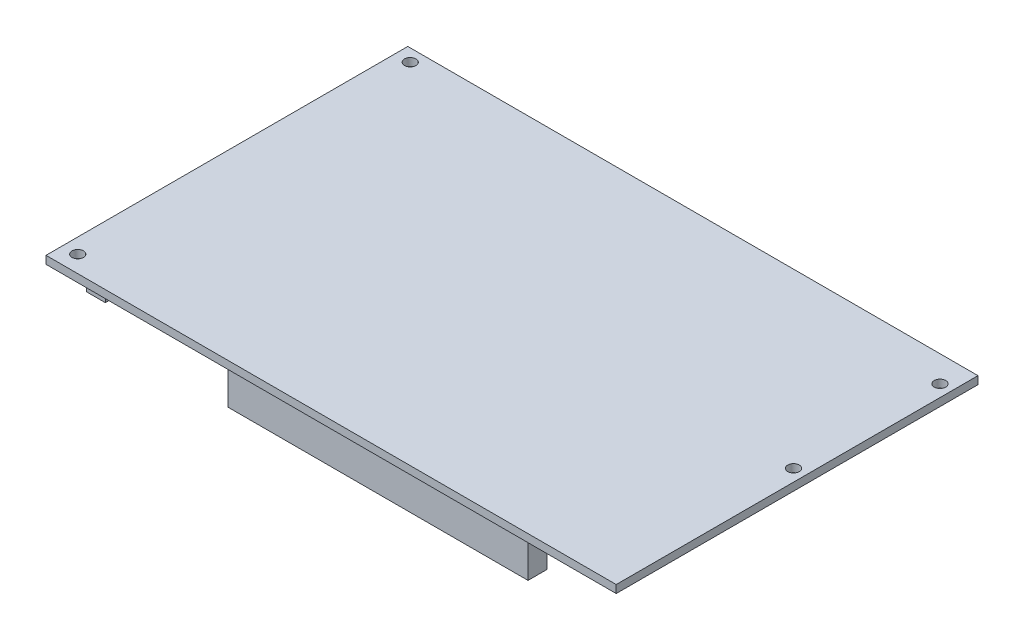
ISO-10303-21;
HEADER;
FILE_DESCRIPTION(('STEP AP214'),'2;1');
FILE_NAME('part.step','',(''),(''),'','','');
FILE_SCHEMA(('AUTOMOTIVE_DESIGN { 1 0 10303 214 1 1 1 1 }'));
ENDSEC;
DATA;
#1=APPLICATION_CONTEXT('core data for automotive mechanical design processes');
#2=APPLICATION_PROTOCOL_DEFINITION('international standard','automotive_design',2000,#1);
#3=PRODUCT_CONTEXT('',#1,'mechanical');
#4=PRODUCT('Part','Part','',(#3));
#5=PRODUCT_RELATED_PRODUCT_CATEGORY('part','',(#4));
#6=PRODUCT_DEFINITION_FORMATION('','',#4);
#7=PRODUCT_DEFINITION_CONTEXT('part definition',#1,'design');
#8=PRODUCT_DEFINITION('design','',#6,#7);
#9=PRODUCT_DEFINITION_SHAPE('','',#8);
#10=(LENGTH_UNIT() NAMED_UNIT(*) SI_UNIT(.MILLI.,.METRE.));
#11=(NAMED_UNIT(*) PLANE_ANGLE_UNIT() SI_UNIT($,.RADIAN.));
#12=(NAMED_UNIT(*) SI_UNIT($,.STERADIAN.) SOLID_ANGLE_UNIT());
#13=UNCERTAINTY_MEASURE_WITH_UNIT(LENGTH_MEASURE(1.E-05),#10,'distance_accuracy_value','');
#14=(GEOMETRIC_REPRESENTATION_CONTEXT(3) GLOBAL_UNCERTAINTY_ASSIGNED_CONTEXT((#13)) GLOBAL_UNIT_ASSIGNED_CONTEXT((#10,
#11,#12)) REPRESENTATION_CONTEXT('',''));
#15=CARTESIAN_POINT('',(0.,0.,0.));
#16=DIRECTION('',(0.,0.,1.));
#17=DIRECTION('',(1.,0.,0.));
#18=AXIS2_PLACEMENT_3D('',#15,#16,#17);
#19=CARTESIAN_POINT('',(0.,0.,-92.5957));
#20=DIRECTION('',(0.,-1.,0.));
#21=DIRECTION('',(0.,0.,-1.));
#22=AXIS2_PLACEMENT_3D('',#19,#20,#21);
#23=PLANE('',#22);
#24=DIRECTION('',(1.,0.,0.));
#25=VECTOR('',#24,1.);
#26=CARTESIAN_POINT('',(45.212,0.,-6.2357));
#27=LINE('',#26,#25);
#28=CARTESIAN_POINT('',(45.212,0.,-6.2357));
#29=VERTEX_POINT('',#28);
#30=CARTESIAN_POINT('',(121.9708,0.,-6.2357));
#31=VERTEX_POINT('',#30);
#32=EDGE_CURVE('E165',#29,#31,#27,.T.);
#33=ORIENTED_EDGE('',*,*,#32,.F.);
#34=DIRECTION('',(0.,0.,-1.));
#35=VECTOR('',#34,1.);
#36=CARTESIAN_POINT('',(45.212,0.,-1.397));
#37=LINE('',#36,#35);
#38=CARTESIAN_POINT('',(45.212,0.,-1.397));
#39=VERTEX_POINT('',#38);
#40=EDGE_CURVE('E134',#39,#29,#37,.T.);
#41=ORIENTED_EDGE('',*,*,#40,.F.);
#42=DIRECTION('',(-1.,0.,0.));
#43=VECTOR('',#42,1.);
#44=CARTESIAN_POINT('',(45.212,0.,-1.397));
#45=LINE('',#44,#43);
#46=CARTESIAN_POINT('',(121.9708,0.,-1.397));
#47=VERTEX_POINT('',#46);
#48=EDGE_CURVE('E169',#47,#39,#45,.T.);
#49=ORIENTED_EDGE('',*,*,#48,.F.);
#50=DIRECTION('',(0.,0.,1.));
#51=VECTOR('',#50,1.);
#52=CARTESIAN_POINT('',(121.9708,0.,-1.397));
#53=LINE('',#52,#51);
#54=EDGE_CURVE('E167',#31,#47,#53,.T.);
#55=ORIENTED_EDGE('',*,*,#54,.F.);
#56=EDGE_LOOP('',(#33,#41,#49,#55));
#57=FACE_BOUND('',#56,.T.);
#58=CARTESIAN_POINT('',(142.875,0.,-85.9155));
#59=DIRECTION('',(0.,1.,0.));
#60=DIRECTION('',(0.,0.,1.));
#61=AXIS2_PLACEMENT_3D('',#58,#59,#60);
#62=CIRCLE('',#61,1.4732);
#63=CARTESIAN_POINT('',(142.875,0.,-84.4423));
#64=VERTEX_POINT('',#63);
#65=EDGE_CURVE('E195',#64,#64,#62,.T.);
#66=ORIENTED_EDGE('',*,*,#65,.T.);
#67=EDGE_LOOP('',(#66));
#68=FACE_BOUND('',#67,.T.);
#69=CARTESIAN_POINT('',(3.81,0.,-89.408));
#70=DIRECTION('',(0.,1.,0.));
#71=DIRECTION('',(0.,0.,1.));
#72=AXIS2_PLACEMENT_3D('',#69,#70,#71);
#73=CIRCLE('',#72,1.4732);
#74=CARTESIAN_POINT('',(3.81,0.,-87.9348));
#75=VERTEX_POINT('',#74);
#76=EDGE_CURVE('E207',#75,#75,#73,.T.);
#77=ORIENTED_EDGE('',*,*,#76,.T.);
#78=EDGE_LOOP('',(#77));
#79=FACE_BOUND('',#78,.T.);
#80=DIRECTION('',(0.,0.,1.));
#81=VECTOR('',#80,1.);
#82=CARTESIAN_POINT('',(0.,0.,0.));
#83=LINE('',#82,#81);
#84=CARTESIAN_POINT('',(0.,0.,-92.5957));
#85=VERTEX_POINT('',#84);
#86=CARTESIAN_POINT('',(0.,0.,0.));
#87=VERTEX_POINT('',#86);
#88=EDGE_CURVE('E213',#85,#87,#83,.T.);
#89=ORIENTED_EDGE('',*,*,#88,.F.);
#90=DIRECTION('',(-1.,0.,0.));
#91=VECTOR('',#90,1.);
#92=CARTESIAN_POINT('',(0.,0.,-92.5957));
#93=LINE('',#92,#91);
#94=CARTESIAN_POINT('',(145.9357,0.,-92.5957));
#95=VERTEX_POINT('',#94);
#96=EDGE_CURVE('E220',#95,#85,#93,.T.);
#97=ORIENTED_EDGE('',*,*,#96,.F.);
#98=DIRECTION('',(0.,0.,-1.));
#99=VECTOR('',#98,1.);
#100=CARTESIAN_POINT('',(145.9357,0.,0.));
#101=LINE('',#100,#99);
#102=CARTESIAN_POINT('',(145.9357,0.,0.));
#103=VERTEX_POINT('',#102);
#104=EDGE_CURVE('E218',#103,#95,#101,.T.);
#105=ORIENTED_EDGE('',*,*,#104,.F.);
#106=DIRECTION('',(1.,0.,0.));
#107=VECTOR('',#106,1.);
#108=CARTESIAN_POINT('',(0.,0.,0.));
#109=LINE('',#108,#107);
#110=EDGE_CURVE('E216',#87,#103,#109,.T.);
#111=ORIENTED_EDGE('',*,*,#110,.F.);
#112=EDGE_LOOP('',(#89,#97,#105,#111));
#113=FACE_BOUND('',#112,.T.);
#114=CARTESIAN_POINT('',(3.81,0.,-4.318));
#115=DIRECTION('',(0.,1.,0.));
#116=DIRECTION('',(0.,0.,1.));
#117=AXIS2_PLACEMENT_3D('',#114,#115,#116);
#118=CIRCLE('',#117,1.4732);
#119=CARTESIAN_POINT('',(3.81,0.,-2.8448));
#120=VERTEX_POINT('',#119);
#121=EDGE_CURVE('E201',#120,#120,#118,.T.);
#122=ORIENTED_EDGE('',*,*,#121,.T.);
#123=EDGE_LOOP('',(#122));
#124=FACE_BOUND('',#123,.T.);
#125=CARTESIAN_POINT('',(142.875,0.,-48.4505));
#126=DIRECTION('',(0.,1.,0.));
#127=DIRECTION('',(0.,0.,1.));
#128=AXIS2_PLACEMENT_3D('',#125,#126,#127);
#129=CIRCLE('',#128,1.4732);
#130=CARTESIAN_POINT('',(142.875,0.,-46.9773));
#131=VERTEX_POINT('',#130);
#132=EDGE_CURVE('E189',#131,#131,#129,.T.);
#133=ORIENTED_EDGE('',*,*,#132,.T.);
#134=EDGE_LOOP('',(#133));
#135=FACE_BOUND('',#134,.T.);
#136=DIRECTION('',(1.,0.,0.));
#137=VECTOR('',#136,1.);
#138=CARTESIAN_POINT('',(1.47320000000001,0.,-84.836));
#139=LINE('',#138,#137);
#140=CARTESIAN_POINT('',(1.47320000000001,0.,-84.836));
#141=VERTEX_POINT('',#140);
#142=CARTESIAN_POINT('',(6.31190000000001,0.,-84.836));
#143=VERTEX_POINT('',#142);
#144=EDGE_CURVE('E128',#141,#143,#139,.T.);
#145=ORIENTED_EDGE('',*,*,#144,.F.);
#146=DIRECTION('',(0.,0.,-1.));
#147=VECTOR('',#146,1.);
#148=CARTESIAN_POINT('',(1.4732,0.,-8.8646));
#149=LINE('',#148,#147);
#150=CARTESIAN_POINT('',(1.4732,0.,-8.8646));
#151=VERTEX_POINT('',#150);
#152=EDGE_CURVE('E139',#151,#141,#149,.T.);
#153=ORIENTED_EDGE('',*,*,#152,.F.);
#154=DIRECTION('',(-1.,0.,0.));
#155=VECTOR('',#154,1.);
#156=CARTESIAN_POINT('',(1.4732,0.,-8.8646));
#157=LINE('',#156,#155);
#158=CARTESIAN_POINT('',(6.3119,0.,-8.8646));
#159=VERTEX_POINT('',#158);
#160=EDGE_CURVE('E149',#159,#151,#157,.T.);
#161=ORIENTED_EDGE('',*,*,#160,.F.);
#162=DIRECTION('',(0.,0.,1.));
#163=VECTOR('',#162,1.);
#164=CARTESIAN_POINT('',(6.3119,0.,-8.8646));
#165=LINE('',#164,#163);
#166=EDGE_CURVE('E147',#143,#159,#165,.T.);
#167=ORIENTED_EDGE('',*,*,#166,.F.);
#168=EDGE_LOOP('',(#145,#153,#161,#167));
#169=FACE_BOUND('',#168,.T.);
#170=ADVANCED_FACE('F33',(#57,#68,#79,#113,#124,#135,#169),#23,.T.);
#171=CARTESIAN_POINT('',(0.,2.0066,-92.5957));
#172=DIRECTION('',(0.,-1.,0.));
#173=DIRECTION('',(0.,0.,-1.));
#174=AXIS2_PLACEMENT_3D('',#171,#172,#173);
#175=PLANE('',#174);
#176=CARTESIAN_POINT('',(142.875,2.0066,-85.9155));
#177=DIRECTION('',(0.,1.,0.));
#178=DIRECTION('',(0.,0.,1.));
#179=AXIS2_PLACEMENT_3D('',#176,#177,#178);
#180=CIRCLE('',#179,1.4732);
#181=CARTESIAN_POINT('',(142.875,2.0066,-84.4423));
#182=VERTEX_POINT('',#181);
#183=EDGE_CURVE('E198',#182,#182,#180,.T.);
#184=ORIENTED_EDGE('',*,*,#183,.F.);
#185=EDGE_LOOP('',(#184));
#186=FACE_BOUND('',#185,.T.);
#187=CARTESIAN_POINT('',(3.81,2.0066,-89.408));
#188=DIRECTION('',(0.,1.,0.));
#189=DIRECTION('',(0.,0.,1.));
#190=AXIS2_PLACEMENT_3D('',#187,#188,#189);
#191=CIRCLE('',#190,1.4732);
#192=CARTESIAN_POINT('',(3.81,2.0066,-87.9348));
#193=VERTEX_POINT('',#192);
#194=EDGE_CURVE('E210',#193,#193,#191,.T.);
#195=ORIENTED_EDGE('',*,*,#194,.F.);
#196=EDGE_LOOP('',(#195));
#197=FACE_BOUND('',#196,.T.);
#198=DIRECTION('',(0.,0.,1.));
#199=VECTOR('',#198,1.);
#200=CARTESIAN_POINT('',(0.,2.0066,0.));
#201=LINE('',#200,#199);
#202=CARTESIAN_POINT('',(0.,2.0066,-92.5957));
#203=VERTEX_POINT('',#202);
#204=CARTESIAN_POINT('',(0.,2.0066,0.));
#205=VERTEX_POINT('',#204);
#206=EDGE_CURVE('E222',#203,#205,#201,.T.);
#207=ORIENTED_EDGE('',*,*,#206,.T.);
#208=DIRECTION('',(1.,0.,0.));
#209=VECTOR('',#208,1.);
#210=CARTESIAN_POINT('',(0.,2.0066,0.));
#211=LINE('',#210,#209);
#212=CARTESIAN_POINT('',(145.9357,2.0066,0.));
#213=VERTEX_POINT('',#212);
#214=EDGE_CURVE('E225',#205,#213,#211,.T.);
#215=ORIENTED_EDGE('',*,*,#214,.T.);
#216=DIRECTION('',(0.,0.,-1.));
#217=VECTOR('',#216,1.);
#218=CARTESIAN_POINT('',(145.9357,2.0066,0.));
#219=LINE('',#218,#217);
#220=CARTESIAN_POINT('',(145.9357,2.0066,-92.5957));
#221=VERTEX_POINT('',#220);
#222=EDGE_CURVE('E227',#213,#221,#219,.T.);
#223=ORIENTED_EDGE('',*,*,#222,.T.);
#224=DIRECTION('',(-1.,0.,0.));
#225=VECTOR('',#224,1.);
#226=CARTESIAN_POINT('',(0.,2.0066,-92.5957));
#227=LINE('',#226,#225);
#228=EDGE_CURVE('E229',#221,#203,#227,.T.);
#229=ORIENTED_EDGE('',*,*,#228,.T.);
#230=EDGE_LOOP('',(#207,#215,#223,#229));
#231=FACE_BOUND('',#230,.T.);
#232=CARTESIAN_POINT('',(3.81,2.0066,-4.318));
#233=DIRECTION('',(0.,1.,0.));
#234=DIRECTION('',(0.,0.,1.));
#235=AXIS2_PLACEMENT_3D('',#232,#233,#234);
#236=CIRCLE('',#235,1.4732);
#237=CARTESIAN_POINT('',(3.81,2.0066,-2.8448));
#238=VERTEX_POINT('',#237);
#239=EDGE_CURVE('E204',#238,#238,#236,.T.);
#240=ORIENTED_EDGE('',*,*,#239,.F.);
#241=EDGE_LOOP('',(#240));
#242=FACE_BOUND('',#241,.T.);
#243=CARTESIAN_POINT('',(142.875,2.0066,-48.4505));
#244=DIRECTION('',(0.,1.,0.));
#245=DIRECTION('',(0.,0.,1.));
#246=AXIS2_PLACEMENT_3D('',#243,#244,#245);
#247=CIRCLE('',#246,1.4732);
#248=CARTESIAN_POINT('',(142.875,2.0066,-46.9773));
#249=VERTEX_POINT('',#248);
#250=EDGE_CURVE('E192',#249,#249,#247,.T.);
#251=ORIENTED_EDGE('',*,*,#250,.F.);
#252=EDGE_LOOP('',(#251));
#253=FACE_BOUND('',#252,.T.);
#254=ADVANCED_FACE('F256',(#186,#197,#231,#242,#253),#175,.F.);
#255=CARTESIAN_POINT('',(0.,2.0066,0.));
#256=DIRECTION('',(1.,0.,0.));
#257=DIRECTION('',(0.,0.,-1.));
#258=AXIS2_PLACEMENT_3D('',#255,#256,#257);
#259=PLANE('',#258);
#260=ORIENTED_EDGE('',*,*,#88,.T.);
#261=DIRECTION('',(0.,-1.,0.));
#262=VECTOR('',#261,1.);
#263=CARTESIAN_POINT('',(0.,2.0066,0.));
#264=LINE('',#263,#262);
#265=EDGE_CURVE('E11',#205,#87,#264,.T.);
#266=ORIENTED_EDGE('',*,*,#265,.F.);
#267=ORIENTED_EDGE('',*,*,#206,.F.);
#268=DIRECTION('',(0.,-1.,0.));
#269=VECTOR('',#268,1.);
#270=CARTESIAN_POINT('',(0.,2.0066,-92.5957));
#271=LINE('',#270,#269);
#272=EDGE_CURVE('E231',#203,#85,#271,.T.);
#273=ORIENTED_EDGE('',*,*,#272,.T.);
#274=EDGE_LOOP('',(#260,#266,#267,#273));
#275=FACE_BOUND('',#274,.T.);
#276=ADVANCED_FACE('F35',(#275),#259,.F.);
#277=CARTESIAN_POINT('',(0.,2.0066,0.));
#278=DIRECTION('',(0.,0.,-1.));
#279=DIRECTION('',(-1.,0.,0.));
#280=AXIS2_PLACEMENT_3D('',#277,#278,#279);
#281=PLANE('',#280);
#282=ORIENTED_EDGE('',*,*,#110,.T.);
#283=DIRECTION('',(0.,-1.,0.));
#284=VECTOR('',#283,1.);
#285=CARTESIAN_POINT('',(145.9357,2.0066,0.));
#286=LINE('',#285,#284);
#287=EDGE_CURVE('E41',#213,#103,#286,.T.);
#288=ORIENTED_EDGE('',*,*,#287,.F.);
#289=ORIENTED_EDGE('',*,*,#214,.F.);
#290=ORIENTED_EDGE('',*,*,#265,.T.);
#291=EDGE_LOOP('',(#282,#288,#289,#290));
#292=FACE_BOUND('',#291,.T.);
#293=ADVANCED_FACE('F258',(#292),#281,.F.);
#294=CARTESIAN_POINT('',(145.9357,2.0066,0.));
#295=DIRECTION('',(-1.,0.,0.));
#296=DIRECTION('',(0.,0.,1.));
#297=AXIS2_PLACEMENT_3D('',#294,#295,#296);
#298=PLANE('',#297);
#299=ORIENTED_EDGE('',*,*,#104,.T.);
#300=DIRECTION('',(0.,-1.,0.));
#301=VECTOR('',#300,1.);
#302=CARTESIAN_POINT('',(145.9357,2.0066,-92.5957));
#303=LINE('',#302,#301);
#304=EDGE_CURVE('E234',#221,#95,#303,.T.);
#305=ORIENTED_EDGE('',*,*,#304,.F.);
#306=ORIENTED_EDGE('',*,*,#222,.F.);
#307=ORIENTED_EDGE('',*,*,#287,.T.);
#308=EDGE_LOOP('',(#299,#305,#306,#307));
#309=FACE_BOUND('',#308,.T.);
#310=ADVANCED_FACE('F241',(#309),#298,.F.);
#311=CARTESIAN_POINT('',(0.,2.0066,-92.5957));
#312=DIRECTION('',(0.,0.,1.));
#313=DIRECTION('',(1.,0.,0.));
#314=AXIS2_PLACEMENT_3D('',#311,#312,#313);
#315=PLANE('',#314);
#316=ORIENTED_EDGE('',*,*,#96,.T.);
#317=ORIENTED_EDGE('',*,*,#272,.F.);
#318=ORIENTED_EDGE('',*,*,#228,.F.);
#319=ORIENTED_EDGE('',*,*,#304,.T.);
#320=EDGE_LOOP('',(#316,#317,#318,#319));
#321=FACE_BOUND('',#320,.T.);
#322=ADVANCED_FACE('F250',(#321),#315,.F.);
#323=CARTESIAN_POINT('',(3.81,2.0066,-89.408));
#324=DIRECTION('',(0.,-1.,0.));
#325=DIRECTION('',(0.,0.,-1.));
#326=AXIS2_PLACEMENT_3D('',#323,#324,#325);
#327=CYLINDRICAL_SURFACE('',#326,1.4732);
#328=ORIENTED_EDGE('',*,*,#194,.T.);
#329=EDGE_LOOP('',(#328));
#330=FACE_BOUND('',#329,.T.);
#331=ORIENTED_EDGE('',*,*,#76,.F.);
#332=EDGE_LOOP('',(#331));
#333=FACE_BOUND('',#332,.T.);
#334=ADVANCED_FACE('F276',(#330,#333),#327,.F.);
#335=CARTESIAN_POINT('',(3.81,2.0066,-4.318));
#336=DIRECTION('',(0.,-1.,0.));
#337=DIRECTION('',(0.,0.,-1.));
#338=AXIS2_PLACEMENT_3D('',#335,#336,#337);
#339=CYLINDRICAL_SURFACE('',#338,1.4732);
#340=ORIENTED_EDGE('',*,*,#239,.T.);
#341=EDGE_LOOP('',(#340));
#342=FACE_BOUND('',#341,.T.);
#343=ORIENTED_EDGE('',*,*,#121,.F.);
#344=EDGE_LOOP('',(#343));
#345=FACE_BOUND('',#344,.T.);
#346=ADVANCED_FACE('F283',(#342,#345),#339,.F.);
#347=CARTESIAN_POINT('',(142.875,2.0066,-85.9155));
#348=DIRECTION('',(0.,-1.,0.));
#349=DIRECTION('',(0.,0.,-1.));
#350=AXIS2_PLACEMENT_3D('',#347,#348,#349);
#351=CYLINDRICAL_SURFACE('',#350,1.4732);
#352=ORIENTED_EDGE('',*,*,#183,.T.);
#353=EDGE_LOOP('',(#352));
#354=FACE_BOUND('',#353,.T.);
#355=ORIENTED_EDGE('',*,*,#65,.F.);
#356=EDGE_LOOP('',(#355));
#357=FACE_BOUND('',#356,.T.);
#358=ADVANCED_FACE('F288',(#354,#357),#351,.F.);
#359=CARTESIAN_POINT('',(142.875,2.0066,-48.4505));
#360=DIRECTION('',(0.,-1.,0.));
#361=DIRECTION('',(0.,0.,-1.));
#362=AXIS2_PLACEMENT_3D('',#359,#360,#361);
#363=CYLINDRICAL_SURFACE('',#362,1.4732);
#364=ORIENTED_EDGE('',*,*,#250,.T.);
#365=EDGE_LOOP('',(#364));
#366=FACE_BOUND('',#365,.T.);
#367=ORIENTED_EDGE('',*,*,#132,.F.);
#368=EDGE_LOOP('',(#367));
#369=FACE_BOUND('',#368,.T.);
#370=ADVANCED_FACE('F298',(#366,#369),#363,.F.);
#371=CARTESIAN_POINT('',(45.212,-9.7663,-1.397));
#372=DIRECTION('',(1.,0.,0.));
#373=DIRECTION('',(0.,0.,-1.));
#374=AXIS2_PLACEMENT_3D('',#371,#372,#373);
#375=PLANE('',#374);
#376=ORIENTED_EDGE('',*,*,#40,.T.);
#377=DIRECTION('',(0.,1.,0.));
#378=VECTOR('',#377,1.);
#379=CARTESIAN_POINT('',(45.212,-9.7663,-6.2357));
#380=LINE('',#379,#378);
#381=CARTESIAN_POINT('',(45.212,-9.7663,-6.2357));
#382=VERTEX_POINT('',#381);
#383=EDGE_CURVE('E187',#382,#29,#380,.T.);
#384=ORIENTED_EDGE('',*,*,#383,.F.);
#385=DIRECTION('',(0.,0.,-1.));
#386=VECTOR('',#385,1.);
#387=CARTESIAN_POINT('',(45.212,-9.7663,-1.397));
#388=LINE('',#387,#386);
#389=CARTESIAN_POINT('',(45.212,-9.7663,-1.397));
#390=VERTEX_POINT('',#389);
#391=EDGE_CURVE('E171',#390,#382,#388,.T.);
#392=ORIENTED_EDGE('',*,*,#391,.F.);
#393=DIRECTION('',(0.,1.,0.));
#394=VECTOR('',#393,1.);
#395=CARTESIAN_POINT('',(45.212,-9.7663,-1.397));
#396=LINE('',#395,#394);
#397=EDGE_CURVE('E180',#390,#39,#396,.T.);
#398=ORIENTED_EDGE('',*,*,#397,.T.);
#399=EDGE_LOOP('',(#376,#384,#392,#398));
#400=FACE_BOUND('',#399,.T.);
#401=ADVANCED_FACE('F305',(#400),#375,.F.);
#402=CARTESIAN_POINT('',(45.212,-9.7663,-6.2357));
#403=DIRECTION('',(0.,0.,1.));
#404=DIRECTION('',(1.,0.,0.));
#405=AXIS2_PLACEMENT_3D('',#402,#403,#404);
#406=PLANE('',#405);
#407=ORIENTED_EDGE('',*,*,#32,.T.);
#408=DIRECTION('',(0.,1.,0.));
#409=VECTOR('',#408,1.);
#410=CARTESIAN_POINT('',(121.9708,-9.7663,-6.2357));
#411=LINE('',#410,#409);
#412=CARTESIAN_POINT('',(121.9708,-9.7663,-6.2357));
#413=VERTEX_POINT('',#412);
#414=EDGE_CURVE('E184',#413,#31,#411,.T.);
#415=ORIENTED_EDGE('',*,*,#414,.F.);
#416=DIRECTION('',(1.,0.,0.));
#417=VECTOR('',#416,1.);
#418=CARTESIAN_POINT('',(45.212,-9.7663,-6.2357));
#419=LINE('',#418,#417);
#420=EDGE_CURVE('E174',#382,#413,#419,.T.);
#421=ORIENTED_EDGE('',*,*,#420,.F.);
#422=ORIENTED_EDGE('',*,*,#383,.T.);
#423=EDGE_LOOP('',(#407,#415,#421,#422));
#424=FACE_BOUND('',#423,.T.);
#425=ADVANCED_FACE('F309',(#424),#406,.F.);
#426=CARTESIAN_POINT('',(121.9708,-9.7663,-1.397));
#427=DIRECTION('',(-1.,0.,0.));
#428=DIRECTION('',(0.,0.,1.));
#429=AXIS2_PLACEMENT_3D('',#426,#427,#428);
#430=PLANE('',#429);
#431=ORIENTED_EDGE('',*,*,#54,.T.);
#432=DIRECTION('',(0.,1.,0.));
#433=VECTOR('',#432,1.);
#434=CARTESIAN_POINT('',(121.9708,-9.7663,-1.397));
#435=LINE('',#434,#433);
#436=CARTESIAN_POINT('',(121.9708,-9.7663,-1.397));
#437=VERTEX_POINT('',#436);
#438=EDGE_CURVE('E56',#437,#47,#435,.T.);
#439=ORIENTED_EDGE('',*,*,#438,.F.);
#440=DIRECTION('',(0.,0.,1.));
#441=VECTOR('',#440,1.);
#442=CARTESIAN_POINT('',(121.9708,-9.7663,-1.397));
#443=LINE('',#442,#441);
#444=EDGE_CURVE('E176',#413,#437,#443,.T.);
#445=ORIENTED_EDGE('',*,*,#444,.F.);
#446=ORIENTED_EDGE('',*,*,#414,.T.);
#447=EDGE_LOOP('',(#431,#439,#445,#446));
#448=FACE_BOUND('',#447,.T.);
#449=ADVANCED_FACE('F313',(#448),#430,.F.);
#450=CARTESIAN_POINT('',(45.212,-9.7663,-1.397));
#451=DIRECTION('',(0.,0.,-1.));
#452=DIRECTION('',(-1.,0.,0.));
#453=AXIS2_PLACEMENT_3D('',#450,#451,#452);
#454=PLANE('',#453);
#455=ORIENTED_EDGE('',*,*,#48,.T.);
#456=ORIENTED_EDGE('',*,*,#397,.F.);
#457=DIRECTION('',(-1.,0.,0.));
#458=VECTOR('',#457,1.);
#459=CARTESIAN_POINT('',(45.212,-9.7663,-1.397));
#460=LINE('',#459,#458);
#461=EDGE_CURVE('E178',#437,#390,#460,.T.);
#462=ORIENTED_EDGE('',*,*,#461,.F.);
#463=ORIENTED_EDGE('',*,*,#438,.T.);
#464=EDGE_LOOP('',(#455,#456,#462,#463));
#465=FACE_BOUND('',#464,.T.);
#466=ADVANCED_FACE('F317',(#465),#454,.F.);
#467=CARTESIAN_POINT('',(45.212,-9.7663,-6.2357));
#468=DIRECTION('',(0.,-1.,0.));
#469=DIRECTION('',(0.,0.,-1.));
#470=AXIS2_PLACEMENT_3D('',#467,#468,#469);
#471=PLANE('',#470);
#472=ORIENTED_EDGE('',*,*,#391,.T.);
#473=ORIENTED_EDGE('',*,*,#420,.T.);
#474=ORIENTED_EDGE('',*,*,#444,.T.);
#475=ORIENTED_EDGE('',*,*,#461,.T.);
#476=EDGE_LOOP('',(#472,#473,#474,#475));
#477=FACE_BOUND('',#476,.T.);
#478=ADVANCED_FACE('F321',(#477),#471,.T.);
#479=CARTESIAN_POINT('',(1.4732,-9.7663,-8.8646));
#480=DIRECTION('',(1.,0.,0.));
#481=DIRECTION('',(0.,0.,-1.));
#482=AXIS2_PLACEMENT_3D('',#479,#480,#481);
#483=PLANE('',#482);
#484=ORIENTED_EDGE('',*,*,#152,.T.);
#485=DIRECTION('',(0.,1.,0.));
#486=VECTOR('',#485,1.);
#487=CARTESIAN_POINT('',(1.47320000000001,-9.7663,-84.836));
#488=LINE('',#487,#486);
#489=CARTESIAN_POINT('',(1.47320000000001,-9.7663,-84.836));
#490=VERTEX_POINT('',#489);
#491=EDGE_CURVE('E123',#490,#141,#488,.T.);
#492=ORIENTED_EDGE('',*,*,#491,.F.);
#493=DIRECTION('',(0.,0.,-1.));
#494=VECTOR('',#493,1.);
#495=CARTESIAN_POINT('',(1.4732,-9.7663,-8.8646));
#496=LINE('',#495,#494);
#497=CARTESIAN_POINT('',(1.4732,-9.7663,-8.8646));
#498=VERTEX_POINT('',#497);
#499=EDGE_CURVE('E153',#498,#490,#496,.T.);
#500=ORIENTED_EDGE('',*,*,#499,.F.);
#501=DIRECTION('',(0.,1.,0.));
#502=VECTOR('',#501,1.);
#503=CARTESIAN_POINT('',(1.4732,-9.7663,-8.8646));
#504=LINE('',#503,#502);
#505=EDGE_CURVE('E142',#498,#151,#504,.T.);
#506=ORIENTED_EDGE('',*,*,#505,.T.);
#507=EDGE_LOOP('',(#484,#492,#500,#506));
#508=FACE_BOUND('',#507,.T.);
#509=ADVANCED_FACE('F140',(#508),#483,.F.);
#510=CARTESIAN_POINT('',(1.47320000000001,-9.7663,-84.836));
#511=DIRECTION('',(0.,0.,1.));
#512=DIRECTION('',(1.,0.,0.));
#513=AXIS2_PLACEMENT_3D('',#510,#511,#512);
#514=PLANE('',#513);
#515=ORIENTED_EDGE('',*,*,#144,.T.);
#516=DIRECTION('',(0.,1.,0.));
#517=VECTOR('',#516,1.);
#518=CARTESIAN_POINT('',(6.31190000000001,-9.7663,-84.836));
#519=LINE('',#518,#517);
#520=CARTESIAN_POINT('',(6.31190000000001,-9.7663,-84.836));
#521=VERTEX_POINT('',#520);
#522=EDGE_CURVE('E135',#521,#143,#519,.T.);
#523=ORIENTED_EDGE('',*,*,#522,.F.);
#524=DIRECTION('',(1.,0.,0.));
#525=VECTOR('',#524,1.);
#526=CARTESIAN_POINT('',(1.47320000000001,-9.7663,-84.836));
#527=LINE('',#526,#525);
#528=EDGE_CURVE('E130',#490,#521,#527,.T.);
#529=ORIENTED_EDGE('',*,*,#528,.F.);
#530=ORIENTED_EDGE('',*,*,#491,.T.);
#531=EDGE_LOOP('',(#515,#523,#529,#530));
#532=FACE_BOUND('',#531,.T.);
#533=ADVANCED_FACE('F125',(#532),#514,.F.);
#534=CARTESIAN_POINT('',(6.3119,-9.7663,-8.8646));
#535=DIRECTION('',(-1.,0.,0.));
#536=DIRECTION('',(0.,0.,1.));
#537=AXIS2_PLACEMENT_3D('',#534,#535,#536);
#538=PLANE('',#537);
#539=ORIENTED_EDGE('',*,*,#166,.T.);
#540=DIRECTION('',(0.,1.,0.));
#541=VECTOR('',#540,1.);
#542=CARTESIAN_POINT('',(6.3119,-9.7663,-8.8646));
#543=LINE('',#542,#541);
#544=CARTESIAN_POINT('',(6.3119,-9.7663,-8.8646));
#545=VERTEX_POINT('',#544);
#546=EDGE_CURVE('E48',#545,#159,#543,.T.);
#547=ORIENTED_EDGE('',*,*,#546,.F.);
#548=DIRECTION('',(0.,0.,1.));
#549=VECTOR('',#548,1.);
#550=CARTESIAN_POINT('',(6.3119,-9.7663,-8.8646));
#551=LINE('',#550,#549);
#552=EDGE_CURVE('E156',#521,#545,#551,.T.);
#553=ORIENTED_EDGE('',*,*,#552,.F.);
#554=ORIENTED_EDGE('',*,*,#522,.T.);
#555=EDGE_LOOP('',(#539,#547,#553,#554));
#556=FACE_BOUND('',#555,.T.);
#557=ADVANCED_FACE('F329',(#556),#538,.F.);
#558=CARTESIAN_POINT('',(1.4732,-9.7663,-8.8646));
#559=DIRECTION('',(0.,0.,-1.));
#560=DIRECTION('',(-1.,0.,0.));
#561=AXIS2_PLACEMENT_3D('',#558,#559,#560);
#562=PLANE('',#561);
#563=ORIENTED_EDGE('',*,*,#160,.T.);
#564=ORIENTED_EDGE('',*,*,#505,.F.);
#565=DIRECTION('',(-1.,0.,0.));
#566=VECTOR('',#565,1.);
#567=CARTESIAN_POINT('',(1.4732,-9.7663,-8.8646));
#568=LINE('',#567,#566);
#569=EDGE_CURVE('E158',#545,#498,#568,.T.);
#570=ORIENTED_EDGE('',*,*,#569,.F.);
#571=ORIENTED_EDGE('',*,*,#546,.T.);
#572=EDGE_LOOP('',(#563,#564,#570,#571));
#573=FACE_BOUND('',#572,.T.);
#574=ADVANCED_FACE('F332',(#573),#562,.F.);
#575=CARTESIAN_POINT('',(1.47320000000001,-9.7663,-84.836));
#576=DIRECTION('',(0.,-1.,0.));
#577=DIRECTION('',(0.,0.,-1.));
#578=AXIS2_PLACEMENT_3D('',#575,#576,#577);
#579=PLANE('',#578);
#580=ORIENTED_EDGE('',*,*,#499,.T.);
#581=ORIENTED_EDGE('',*,*,#528,.T.);
#582=ORIENTED_EDGE('',*,*,#552,.T.);
#583=ORIENTED_EDGE('',*,*,#569,.T.);
#584=EDGE_LOOP('',(#580,#581,#582,#583));
#585=FACE_BOUND('',#584,.T.);
#586=ADVANCED_FACE('F336',(#585),#579,.T.);
#587=CLOSED_SHELL('',(#170,#254,#276,#293,#310,#322,#334,#346,#358,#370,#401,#425,#449,#466,
#478,#509,#533,#557,#574,#586));
#588=MANIFOLD_SOLID_BREP('B2',#587);
#589=ADVANCED_BREP_SHAPE_REPRESENTATION('',(#18,#588),#14);
#590=SHAPE_DEFINITION_REPRESENTATION(#9,#589);
ENDSEC;
END-ISO-10303-21;
